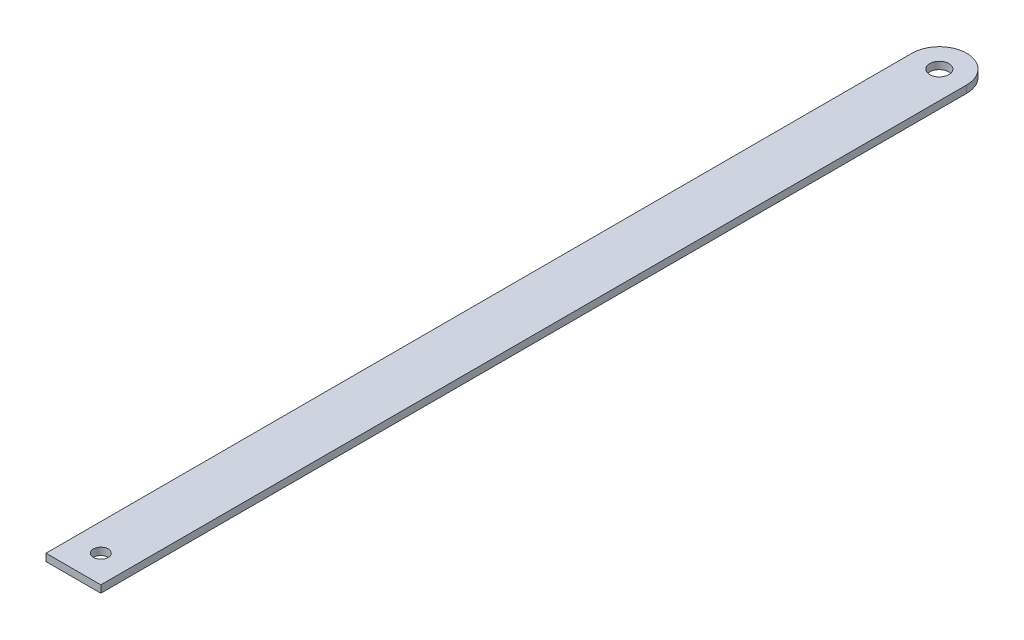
from build123d import *

# Parameters (mm, degrees)
SCHIZZO1_R                   = 5.25
SCHIZZO1_R_2                 = 4.05
ESTRUSIONE_ESTRUSIONE1_DEPTH = 4


with BuildPart() as part:
    # Schizzo1 → Estrusione-Estrusione1 (new body)
    with BuildSketch(Plane(origin=(0, 0, 0), x_dir=(1, 0, 0), z_dir=(0, 1, 0))):
        with BuildLine():
            Line((1126.635094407, 1873.525970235), (1126.635094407, 1399.608461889))
            Line((1126.635094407, 1399.608461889), (1156.635094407, 1399.608461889))
            Line((1156.635094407, 1399.608461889), (1156.635094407, 1873.525970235))
            ThreePointArc((1156.635094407, 1873.525970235), (1141.635094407, 1888.525970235), (1126.635094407, 1873.525970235))
        make_face()
        with Locations(Location((1141.635094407, 1873.525970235, 0), (0, 0, 270))):
            Circle(SCHIZZO1_R, mode=Mode.SUBTRACT)
        with Locations(Location((1141.635094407, 1414.608461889, 0), (0, 0, 270))):
            Circle(SCHIZZO1_R_2, mode=Mode.SUBTRACT)
    extrude(amount=ESTRUSIONE_ESTRUSIONE1_DEPTH)


solid = part.part
